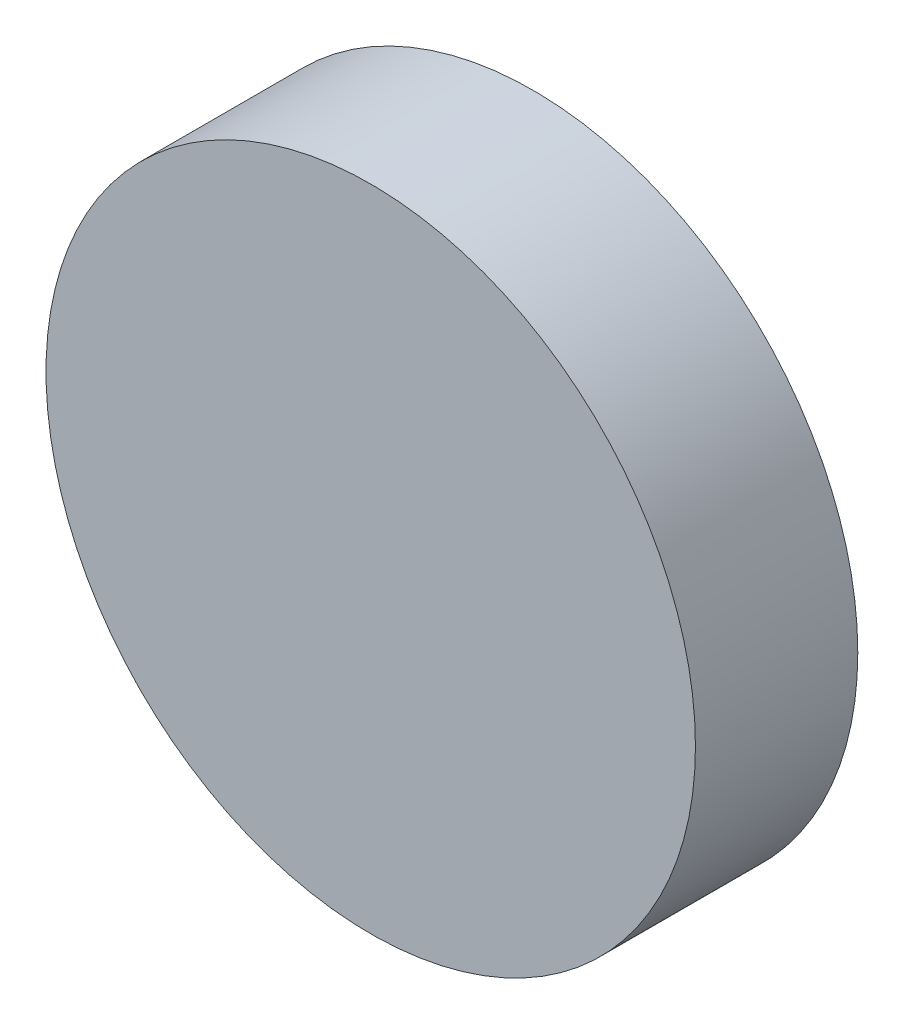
from build123d import *

# Parameters (mm, degrees)
ESQUISSE1_R        = 60
BOSS_EXTRU_1_DEPTH = 30


with BuildPart() as part:
    # Esquisse1 → Boss.-Extru.1 (new body)
    with BuildSketch(Plane.XY):
        Circle(ESQUISSE1_R)
    extrude(amount=BOSS_EXTRU_1_DEPTH)


solid = part.part
